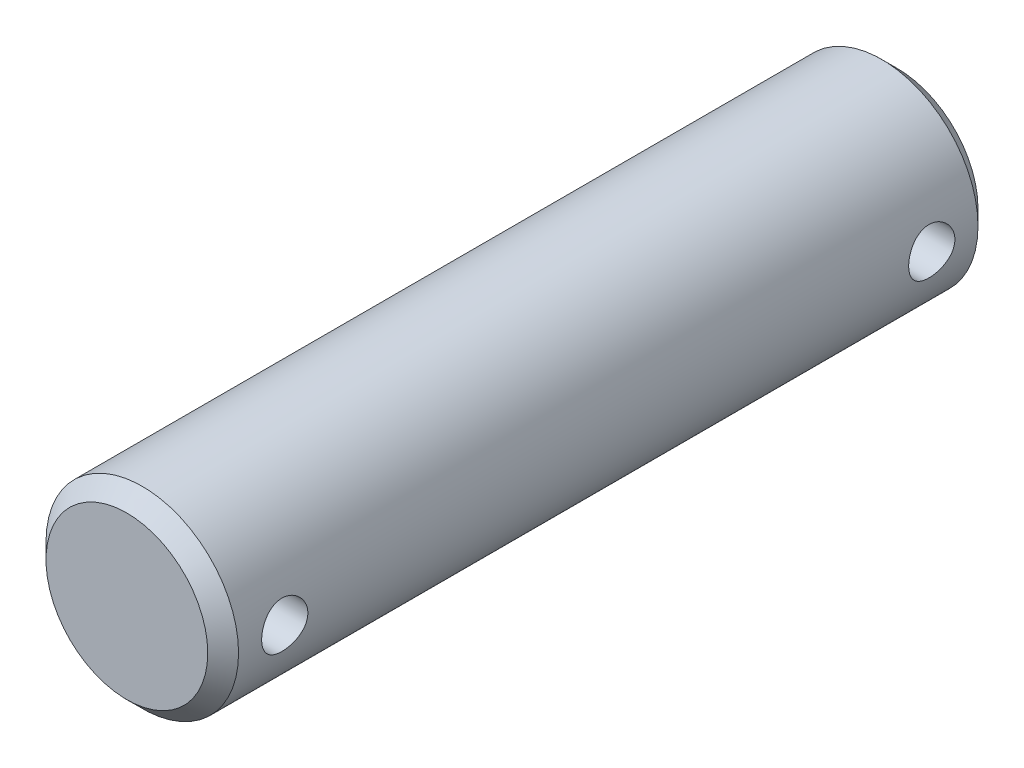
from build123d import *

# Parameters (mm, degrees)
ESQUISSE1_R             = 12.5
BASE_EXTRUSION_DEPTH    = 100
CHANFREIN1_SIZE         = 2
ESQUISSE2_R             = 3
ENL_V_MAT_EXTRU_1_DEPTH = 14


with BuildPart() as part:
    # Esquisse1 → Base-Extrusion (new body)
    with BuildSketch(Plane.XY):
        Circle(ESQUISSE1_R)
    extrude(amount=BASE_EXTRUSION_DEPTH)

    # Chanfrein1
    chanfrein1_edges = [part.edges().sort_by_distance(p)[0] for p in [
        (-12.5, 0, 0),
        (-12.5, 0, 100),
    ]]
    chamfer(chanfrein1_edges, length=CHANFREIN1_SIZE)

    # Esquisse2 → Enl_v. mat.-Extru.1 (cut, symmetric)
    with BuildSketch(Plane(origin=(0, 0, 0), x_dir=(0, 0, -1), z_dir=(1, 0, 0))):
        with Locations(Location((-8, 0, 0), (0, 0, 180))):
            Circle(ESQUISSE2_R)
        with Locations(Location((-92, 0, 0), (0, 0, 180))):
            Circle(ESQUISSE2_R)
    extrude(amount=ENL_V_MAT_EXTRU_1_DEPTH, both=True, mode=Mode.SUBTRACT)


solid = part.part
